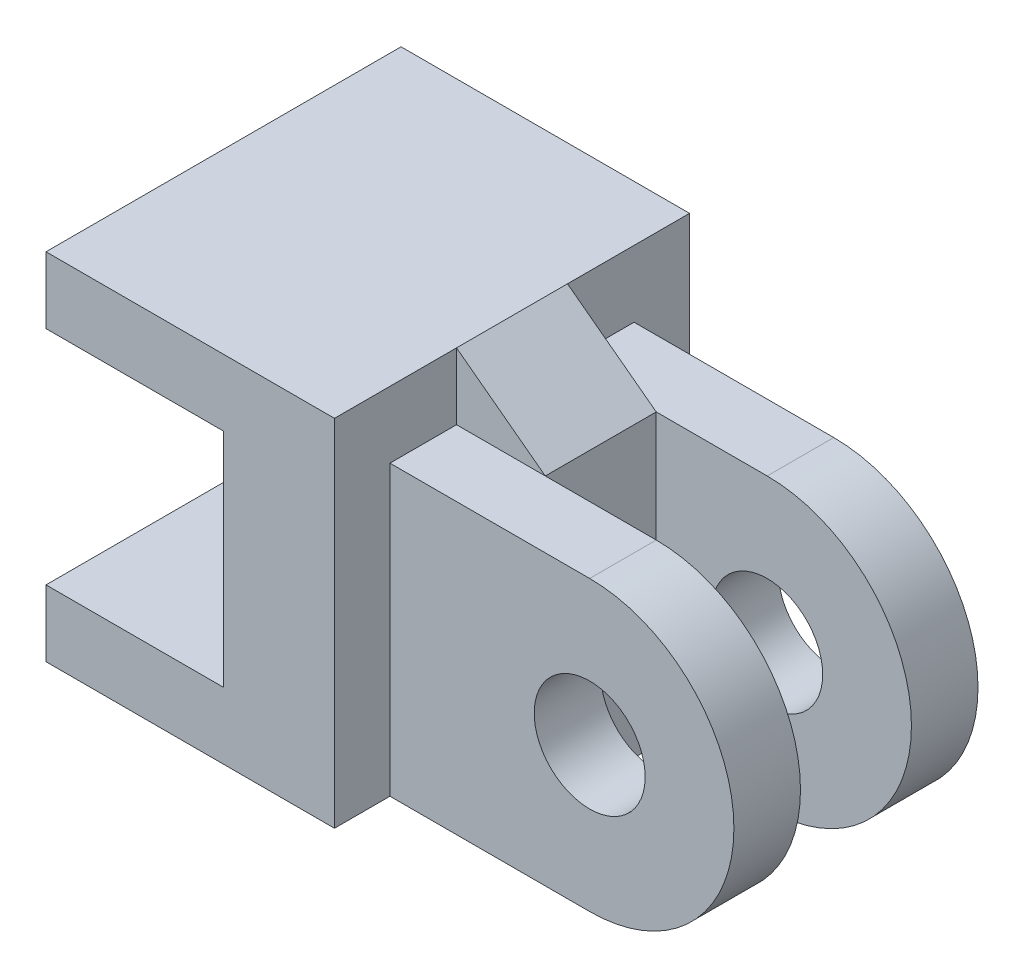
from build123d import *

# Parameters (mm, degrees)
EXTRUDE1_DEPTH = 40
EXTRUDE2_DEPTH = 12.5
SKETCH3_R      = 12.5
EXTRUDE3_DEPTH = 15


with BuildPart() as part:
    # Sketch1 → Extrude1 (new, symmetric)
    with BuildSketch(Plane.XY):
        Polygon((0, -25), (0, 25), (-40, 25), (-40, 40), (25, 40), (25, -40), (-40, -40), (-40, -25), align=None)
    extrude(amount=EXTRUDE1_DEPTH, both=True)

    # Sketch2 → Extrude2 (add, symmetric)
    with BuildSketch(Plane.XY):
        Polygon((25, 40), (45, 25), (45, -40), (25, -40), align=None)
    extrude(amount=EXTRUDE2_DEPTH, both=True)

    # Sketch3 → Extrude3 (add)
    with BuildSketch(Plane.XY.offset(12.5)):
        with BuildLine():
            Line((25, -40), (70, -40))
            ThreePointArc((70, -40), (102.5, -7.5), (70, 25))
            Line((70, 25), (25, 25))
            Line((25, 25), (25, -40))
        make_face()
        with Locations((70, -7.5)):
            Circle(SKETCH3_R, mode=Mode.SUBTRACT)
    extrude(amount=EXTRUDE3_DEPTH)

    # Mirror1: part across plane


with BuildPart() as part_1:
    add(part.part)
    add(part.part.mirror(Plane.XY))


solid = part_1.part
